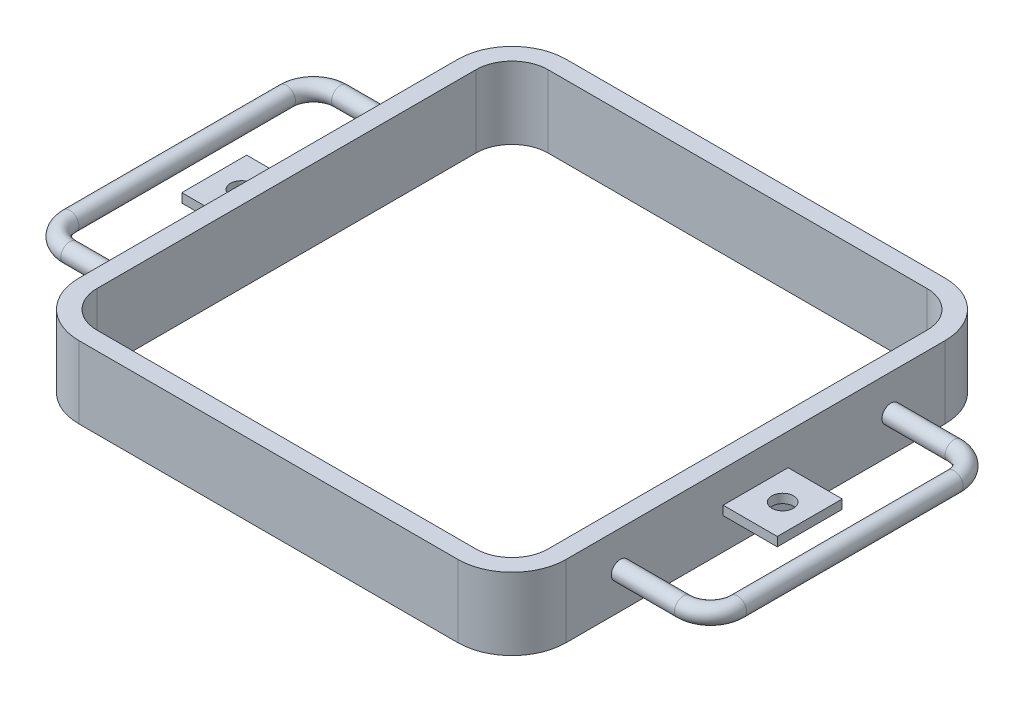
ISO-10303-21;
HEADER;
FILE_DESCRIPTION(('STEP AP214'),'2;1');
FILE_NAME('part.step','',(''),(''),'','','');
FILE_SCHEMA(('AUTOMOTIVE_DESIGN { 1 0 10303 214 1 1 1 1 }'));
ENDSEC;
DATA;
#1=APPLICATION_CONTEXT('core data for automotive mechanical design processes');
#2=APPLICATION_PROTOCOL_DEFINITION('international standard','automotive_design',2000,#1);
#3=PRODUCT_CONTEXT('',#1,'mechanical');
#4=PRODUCT('Part','Part','',(#3));
#5=PRODUCT_RELATED_PRODUCT_CATEGORY('part','',(#4));
#6=PRODUCT_DEFINITION_FORMATION('','',#4);
#7=PRODUCT_DEFINITION_CONTEXT('part definition',#1,'design');
#8=PRODUCT_DEFINITION('design','',#6,#7);
#9=PRODUCT_DEFINITION_SHAPE('','',#8);
#10=(LENGTH_UNIT() NAMED_UNIT(*) SI_UNIT(.MILLI.,.METRE.));
#11=(NAMED_UNIT(*) PLANE_ANGLE_UNIT() SI_UNIT($,.RADIAN.));
#12=(NAMED_UNIT(*) SI_UNIT($,.STERADIAN.) SOLID_ANGLE_UNIT());
#13=UNCERTAINTY_MEASURE_WITH_UNIT(LENGTH_MEASURE(1.E-05),#10,'distance_accuracy_value','');
#14=(GEOMETRIC_REPRESENTATION_CONTEXT(3) GLOBAL_UNCERTAINTY_ASSIGNED_CONTEXT((#13)) GLOBAL_UNIT_ASSIGNED_CONTEXT((#10,
#11,#12)) REPRESENTATION_CONTEXT('',''));
#15=CARTESIAN_POINT('',(0.,0.,0.));
#16=DIRECTION('',(0.,0.,1.));
#17=DIRECTION('',(1.,0.,0.));
#18=AXIS2_PLACEMENT_3D('',#15,#16,#17);
#19=CARTESIAN_POINT('',(135.,20.,-105.));
#20=DIRECTION('',(-1.,0.,0.));
#21=DIRECTION('',(0.,0.,1.));
#22=AXIS2_PLACEMENT_3D('',#19,#20,#21);
#23=PLANE('',#22);
#24=DIRECTION('',(0.,0.,-1.));
#25=VECTOR('',#24,1.);
#26=CARTESIAN_POINT('',(135.,-20.,-105.));
#27=LINE('',#26,#25);
#28=CARTESIAN_POINT('',(135.,-20.,105.));
#29=VERTEX_POINT('',#28);
#30=CARTESIAN_POINT('',(135.,-20.,-105.));
#31=VERTEX_POINT('',#30);
#32=EDGE_CURVE('E381',#29,#31,#27,.T.);
#33=ORIENTED_EDGE('',*,*,#32,.T.);
#34=DIRECTION('',(0.,-1.,0.));
#35=VECTOR('',#34,1.);
#36=CARTESIAN_POINT('',(135.,20.,-105.));
#37=LINE('',#36,#35);
#38=CARTESIAN_POINT('',(135.,20.,-105.));
#39=VERTEX_POINT('',#38);
#40=EDGE_CURVE('E391',#39,#31,#37,.T.);
#41=ORIENTED_EDGE('',*,*,#40,.F.);
#42=DIRECTION('',(0.,0.,-1.));
#43=VECTOR('',#42,1.);
#44=CARTESIAN_POINT('',(135.,20.,-105.));
#45=LINE('',#44,#43);
#46=CARTESIAN_POINT('',(135.,20.,105.));
#47=VERTEX_POINT('',#46);
#48=EDGE_CURVE('E364',#47,#39,#45,.T.);
#49=ORIENTED_EDGE('',*,*,#48,.F.);
#50=DIRECTION('',(0.,-1.,0.));
#51=VECTOR('',#50,1.);
#52=CARTESIAN_POINT('',(135.,20.,105.));
#53=LINE('',#52,#51);
#54=EDGE_CURVE('E394',#47,#29,#53,.T.);
#55=ORIENTED_EDGE('',*,*,#54,.T.);
#56=EDGE_LOOP('',(#33,#41,#49,#55));
#57=FACE_BOUND('',#56,.T.);
#58=CARTESIAN_POINT('',(135.,0.,-75.));
#59=DIRECTION('',(1.,0.,0.));
#60=DIRECTION('',(0.,0.,-1.));
#61=AXIS2_PLACEMENT_3D('',#58,#59,#60);
#62=CIRCLE('',#61,5.);
#63=CARTESIAN_POINT('',(135.,0.,-80.));
#64=VERTEX_POINT('',#63);
#65=EDGE_CURVE('E237',#64,#64,#62,.F.);
#66=ORIENTED_EDGE('',*,*,#65,.T.);
#67=EDGE_LOOP('',(#66));
#68=FACE_BOUND('',#67,.T.);
#69=CARTESIAN_POINT('',(135.,0.,75.));
#70=DIRECTION('',(-1.,0.,0.));
#71=DIRECTION('',(0.,0.,1.));
#72=AXIS2_PLACEMENT_3D('',#69,#70,#71);
#73=CIRCLE('',#72,5.);
#74=CARTESIAN_POINT('',(135.,0.,80.));
#75=VERTEX_POINT('',#74);
#76=EDGE_CURVE('E217',#75,#75,#73,.F.);
#77=ORIENTED_EDGE('',*,*,#76,.F.);
#78=EDGE_LOOP('',(#77));
#79=FACE_BOUND('',#78,.T.);
#80=DIRECTION('',(0.,0.,-1.));
#81=VECTOR('',#80,1.);
#82=CARTESIAN_POINT('',(135.,2.5,-18.));
#83=LINE('',#82,#81);
#84=CARTESIAN_POINT('',(135.,2.5,18.));
#85=VERTEX_POINT('',#84);
#86=CARTESIAN_POINT('',(135.,2.5,-18.));
#87=VERTEX_POINT('',#86);
#88=EDGE_CURVE('E196',#85,#87,#83,.T.);
#89=ORIENTED_EDGE('',*,*,#88,.T.);
#90=DIRECTION('',(0.,-1.,0.));
#91=VECTOR('',#90,1.);
#92=CARTESIAN_POINT('',(135.,2.5,-18.));
#93=LINE('',#92,#91);
#94=CARTESIAN_POINT('',(135.,-2.5,-18.));
#95=VERTEX_POINT('',#94);
#96=EDGE_CURVE('E512',#87,#95,#93,.T.);
#97=ORIENTED_EDGE('',*,*,#96,.T.);
#98=DIRECTION('',(0.,0.,-1.));
#99=VECTOR('',#98,1.);
#100=CARTESIAN_POINT('',(135.,-2.5,-18.));
#101=LINE('',#100,#99);
#102=CARTESIAN_POINT('',(135.,-2.5,18.));
#103=VERTEX_POINT('',#102);
#104=EDGE_CURVE('E216',#103,#95,#101,.T.);
#105=ORIENTED_EDGE('',*,*,#104,.F.);
#106=DIRECTION('',(0.,-1.,0.));
#107=VECTOR('',#106,1.);
#108=CARTESIAN_POINT('',(135.,2.5,18.));
#109=LINE('',#108,#107);
#110=EDGE_CURVE('E211',#85,#103,#109,.T.);
#111=ORIENTED_EDGE('',*,*,#110,.F.);
#112=EDGE_LOOP('',(#89,#97,#105,#111));
#113=FACE_BOUND('',#112,.T.);
#114=ADVANCED_FACE('F33',(#57,#68,#79,#113),#23,.F.);
#115=CARTESIAN_POINT('',(-135.,20.,-105.));
#116=DIRECTION('',(1.,0.,0.));
#117=DIRECTION('',(0.,0.,-1.));
#118=AXIS2_PLACEMENT_3D('',#115,#116,#117);
#119=PLANE('',#118);
#120=DIRECTION('',(0.,0.,1.));
#121=VECTOR('',#120,1.);
#122=CARTESIAN_POINT('',(-135.,-20.,-105.));
#123=LINE('',#122,#121);
#124=CARTESIAN_POINT('',(-135.,-20.,-105.));
#125=VERTEX_POINT('',#124);
#126=CARTESIAN_POINT('',(-135.,-20.,105.));
#127=VERTEX_POINT('',#126);
#128=EDGE_CURVE('E373',#125,#127,#123,.T.);
#129=ORIENTED_EDGE('',*,*,#128,.T.);
#130=DIRECTION('',(0.,-1.,0.));
#131=VECTOR('',#130,1.);
#132=CARTESIAN_POINT('',(-135.,20.,105.));
#133=LINE('',#132,#131);
#134=CARTESIAN_POINT('',(-135.,20.,105.));
#135=VERTEX_POINT('',#134);
#136=EDGE_CURVE('E41',#135,#127,#133,.T.);
#137=ORIENTED_EDGE('',*,*,#136,.F.);
#138=DIRECTION('',(0.,0.,1.));
#139=VECTOR('',#138,1.);
#140=CARTESIAN_POINT('',(-135.,20.,-105.));
#141=LINE('',#140,#139);
#142=CARTESIAN_POINT('',(-135.,20.,-105.));
#143=VERTEX_POINT('',#142);
#144=EDGE_CURVE('E355',#143,#135,#141,.T.);
#145=ORIENTED_EDGE('',*,*,#144,.F.);
#146=DIRECTION('',(0.,-1.,0.));
#147=VECTOR('',#146,1.);
#148=CARTESIAN_POINT('',(-135.,20.,-105.));
#149=LINE('',#148,#147);
#150=EDGE_CURVE('E11',#143,#125,#149,.T.);
#151=ORIENTED_EDGE('',*,*,#150,.T.);
#152=EDGE_LOOP('',(#129,#137,#145,#151));
#153=FACE_BOUND('',#152,.T.);
#154=CARTESIAN_POINT('',(-135.,0.,-75.));
#155=DIRECTION('',(1.,0.,0.));
#156=DIRECTION('',(0.,0.,-1.));
#157=AXIS2_PLACEMENT_3D('',#154,#155,#156);
#158=CIRCLE('',#157,5.);
#159=CARTESIAN_POINT('',(-135.,0.,-80.));
#160=VERTEX_POINT('',#159);
#161=EDGE_CURVE('E289',#160,#160,#158,.T.);
#162=ORIENTED_EDGE('',*,*,#161,.T.);
#163=EDGE_LOOP('',(#162));
#164=FACE_BOUND('',#163,.T.);
#165=CARTESIAN_POINT('',(-135.,0.,75.));
#166=DIRECTION('',(-1.,0.,0.));
#167=DIRECTION('',(0.,0.,1.));
#168=AXIS2_PLACEMENT_3D('',#165,#166,#167);
#169=CIRCLE('',#168,5.);
#170=CARTESIAN_POINT('',(-135.,0.,80.));
#171=VERTEX_POINT('',#170);
#172=EDGE_CURVE('E274',#171,#171,#169,.T.);
#173=ORIENTED_EDGE('',*,*,#172,.F.);
#174=EDGE_LOOP('',(#173));
#175=FACE_BOUND('',#174,.T.);
#176=DIRECTION('',(0.,-1.,0.));
#177=VECTOR('',#176,1.);
#178=CARTESIAN_POINT('',(-135.,2.5,-18.));
#179=LINE('',#178,#177);
#180=CARTESIAN_POINT('',(-135.,2.5,-18.));
#181=VERTEX_POINT('',#180);
#182=CARTESIAN_POINT('',(-135.,-2.5,-18.));
#183=VERTEX_POINT('',#182);
#184=EDGE_CURVE('E56',#181,#183,#179,.T.);
#185=ORIENTED_EDGE('',*,*,#184,.F.);
#186=DIRECTION('',(0.,0.,-1.));
#187=VECTOR('',#186,1.);
#188=CARTESIAN_POINT('',(-135.,2.5,-18.));
#189=LINE('',#188,#187);
#190=CARTESIAN_POINT('',(-135.,2.5,18.));
#191=VERTEX_POINT('',#190);
#192=EDGE_CURVE('E247',#191,#181,#189,.T.);
#193=ORIENTED_EDGE('',*,*,#192,.F.);
#194=DIRECTION('',(0.,-1.,0.));
#195=VECTOR('',#194,1.);
#196=CARTESIAN_POINT('',(-135.,2.5,18.));
#197=LINE('',#196,#195);
#198=CARTESIAN_POINT('',(-135.,-2.5,18.));
#199=VERTEX_POINT('',#198);
#200=EDGE_CURVE('E258',#191,#199,#197,.T.);
#201=ORIENTED_EDGE('',*,*,#200,.T.);
#202=DIRECTION('',(0.,0.,-1.));
#203=VECTOR('',#202,1.);
#204=CARTESIAN_POINT('',(-135.,-2.5,-18.));
#205=LINE('',#204,#203);
#206=EDGE_CURVE('E244',#199,#183,#205,.T.);
#207=ORIENTED_EDGE('',*,*,#206,.T.);
#208=EDGE_LOOP('',(#185,#193,#201,#207));
#209=FACE_BOUND('',#208,.T.);
#210=ADVANCED_FACE('F432',(#153,#164,#175,#209),#119,.F.);
#211=CARTESIAN_POINT('',(-105.,20.,-105.));
#212=DIRECTION('',(0.,1.,0.));
#213=DIRECTION('',(0.,0.,1.));
#214=AXIS2_PLACEMENT_3D('',#211,#212,#213);
#215=PLANE('',#214);
#216=CARTESIAN_POINT('',(-105.,20.,-105.));
#217=DIRECTION('',(0.,1.,0.));
#218=DIRECTION('',(0.,0.,1.));
#219=AXIS2_PLACEMENT_3D('',#216,#217,#218);
#220=CIRCLE('',#219,30.);
#221=CARTESIAN_POINT('',(-105.,20.,-135.));
#222=VERTEX_POINT('',#221);
#223=EDGE_CURVE('E352',#222,#143,#220,.T.);
#224=ORIENTED_EDGE('',*,*,#223,.T.);
#225=ORIENTED_EDGE('',*,*,#144,.T.);
#226=CARTESIAN_POINT('',(-105.,20.,105.));
#227=DIRECTION('',(0.,1.,0.));
#228=DIRECTION('',(0.,0.,1.));
#229=AXIS2_PLACEMENT_3D('',#226,#227,#228);
#230=CIRCLE('',#229,30.);
#231=CARTESIAN_POINT('',(-105.,20.,135.));
#232=VERTEX_POINT('',#231);
#233=EDGE_CURVE('E358',#135,#232,#230,.T.);
#234=ORIENTED_EDGE('',*,*,#233,.T.);
#235=DIRECTION('',(1.,0.,0.));
#236=VECTOR('',#235,1.);
#237=CARTESIAN_POINT('',(-105.,20.,135.));
#238=LINE('',#237,#236);
#239=CARTESIAN_POINT('',(105.,20.,135.));
#240=VERTEX_POINT('',#239);
#241=EDGE_CURVE('E360',#232,#240,#238,.T.);
#242=ORIENTED_EDGE('',*,*,#241,.T.);
#243=CARTESIAN_POINT('',(105.,20.,105.));
#244=DIRECTION('',(0.,1.,0.));
#245=DIRECTION('',(0.,0.,1.));
#246=AXIS2_PLACEMENT_3D('',#243,#244,#245);
#247=CIRCLE('',#246,30.);
#248=EDGE_CURVE('E362',#240,#47,#247,.T.);
#249=ORIENTED_EDGE('',*,*,#248,.T.);
#250=ORIENTED_EDGE('',*,*,#48,.T.);
#251=CARTESIAN_POINT('',(105.,20.,-105.));
#252=DIRECTION('',(0.,1.,0.));
#253=DIRECTION('',(0.,0.,-1.));
#254=AXIS2_PLACEMENT_3D('',#251,#252,#253);
#255=CIRCLE('',#254,30.);
#256=CARTESIAN_POINT('',(105.,20.,-135.));
#257=VERTEX_POINT('',#256);
#258=EDGE_CURVE('E366',#39,#257,#255,.T.);
#259=ORIENTED_EDGE('',*,*,#258,.T.);
#260=DIRECTION('',(-1.,0.,0.));
#261=VECTOR('',#260,1.);
#262=CARTESIAN_POINT('',(-105.,20.,-135.));
#263=LINE('',#262,#261);
#264=EDGE_CURVE('E368',#257,#222,#263,.T.);
#265=ORIENTED_EDGE('',*,*,#264,.T.);
#266=EDGE_LOOP('',(#224,#225,#234,#242,#249,#250,#259,#265));
#267=FACE_BOUND('',#266,.T.);
#268=DIRECTION('',(-1.,0.,0.));
#269=VECTOR('',#268,1.);
#270=CARTESIAN_POINT('',(-105.,20.,-125.));
#271=LINE('',#270,#269);
#272=CARTESIAN_POINT('',(105.,20.,-125.));
#273=VERTEX_POINT('',#272);
#274=CARTESIAN_POINT('',(-105.,20.,-125.));
#275=VERTEX_POINT('',#274);
#276=EDGE_CURVE('E295',#273,#275,#271,.T.);
#277=ORIENTED_EDGE('',*,*,#276,.F.);
#278=CARTESIAN_POINT('',(105.,20.,-105.));
#279=DIRECTION('',(0.,1.,0.));
#280=DIRECTION('',(0.,0.,-1.));
#281=AXIS2_PLACEMENT_3D('',#278,#279,#280);
#282=CIRCLE('',#281,20.);
#283=CARTESIAN_POINT('',(125.,20.,-105.));
#284=VERTEX_POINT('',#283);
#285=EDGE_CURVE('E293',#284,#273,#282,.T.);
#286=ORIENTED_EDGE('',*,*,#285,.F.);
#287=DIRECTION('',(0.,0.,-1.));
#288=VECTOR('',#287,1.);
#289=CARTESIAN_POINT('',(125.,20.,-105.));
#290=LINE('',#289,#288);
#291=CARTESIAN_POINT('',(125.,20.,105.));
#292=VERTEX_POINT('',#291);
#293=EDGE_CURVE('E309',#292,#284,#290,.T.);
#294=ORIENTED_EDGE('',*,*,#293,.F.);
#295=CARTESIAN_POINT('',(105.,20.,105.));
#296=DIRECTION('',(0.,1.,0.));
#297=DIRECTION('',(0.,0.,1.));
#298=AXIS2_PLACEMENT_3D('',#295,#296,#297);
#299=CIRCLE('',#298,20.);
#300=CARTESIAN_POINT('',(105.,20.,125.));
#301=VERTEX_POINT('',#300);
#302=EDGE_CURVE('E306',#301,#292,#299,.T.);
#303=ORIENTED_EDGE('',*,*,#302,.F.);
#304=DIRECTION('',(1.,0.,0.));
#305=VECTOR('',#304,1.);
#306=CARTESIAN_POINT('',(-105.,20.,125.));
#307=LINE('',#306,#305);
#308=CARTESIAN_POINT('',(-105.,20.,125.));
#309=VERTEX_POINT('',#308);
#310=EDGE_CURVE('E304',#309,#301,#307,.T.);
#311=ORIENTED_EDGE('',*,*,#310,.F.);
#312=CARTESIAN_POINT('',(-105.,20.,105.));
#313=DIRECTION('',(0.,1.,0.));
#314=DIRECTION('',(0.,0.,1.));
#315=AXIS2_PLACEMENT_3D('',#312,#313,#314);
#316=CIRCLE('',#315,20.);
#317=CARTESIAN_POINT('',(-125.,20.,105.));
#318=VERTEX_POINT('',#317);
#319=EDGE_CURVE('E302',#318,#309,#316,.T.);
#320=ORIENTED_EDGE('',*,*,#319,.F.);
#321=DIRECTION('',(0.,0.,1.));
#322=VECTOR('',#321,1.);
#323=CARTESIAN_POINT('',(-125.,20.,-105.));
#324=LINE('',#323,#322);
#325=CARTESIAN_POINT('',(-125.,20.,-105.));
#326=VERTEX_POINT('',#325);
#327=EDGE_CURVE('E300',#326,#318,#324,.T.);
#328=ORIENTED_EDGE('',*,*,#327,.F.);
#329=CARTESIAN_POINT('',(-105.,20.,-105.));
#330=DIRECTION('',(0.,1.,0.));
#331=DIRECTION('',(0.,0.,1.));
#332=AXIS2_PLACEMENT_3D('',#329,#330,#331);
#333=CIRCLE('',#332,20.);
#334=EDGE_CURVE('E298',#275,#326,#333,.T.);
#335=ORIENTED_EDGE('',*,*,#334,.F.);
#336=EDGE_LOOP('',(#277,#286,#294,#303,#311,#320,#328,#335));
#337=FACE_BOUND('',#336,.T.);
#338=ADVANCED_FACE('F427',(#267,#337),#215,.T.);
#339=CARTESIAN_POINT('',(-105.,-20.,-105.));
#340=DIRECTION('',(0.,1.,0.));
#341=DIRECTION('',(0.,0.,1.));
#342=AXIS2_PLACEMENT_3D('',#339,#340,#341);
#343=PLANE('',#342);
#344=CARTESIAN_POINT('',(-105.,-20.,-105.));
#345=DIRECTION('',(0.,1.,0.));
#346=DIRECTION('',(0.,0.,1.));
#347=AXIS2_PLACEMENT_3D('',#344,#345,#346);
#348=CIRCLE('',#347,30.);
#349=CARTESIAN_POINT('',(-105.,-20.,-135.));
#350=VERTEX_POINT('',#349);
#351=EDGE_CURVE('E351',#350,#125,#348,.T.);
#352=ORIENTED_EDGE('',*,*,#351,.F.);
#353=DIRECTION('',(-1.,0.,0.));
#354=VECTOR('',#353,1.);
#355=CARTESIAN_POINT('',(-105.,-20.,-135.));
#356=LINE('',#355,#354);
#357=CARTESIAN_POINT('',(105.,-20.,-135.));
#358=VERTEX_POINT('',#357);
#359=EDGE_CURVE('E356',#358,#350,#356,.T.);
#360=ORIENTED_EDGE('',*,*,#359,.F.);
#361=CARTESIAN_POINT('',(105.,-20.,-105.));
#362=DIRECTION('',(0.,1.,0.));
#363=DIRECTION('',(0.,0.,-1.));
#364=AXIS2_PLACEMENT_3D('',#361,#362,#363);
#365=CIRCLE('',#364,30.);
#366=EDGE_CURVE('E383',#31,#358,#365,.T.);
#367=ORIENTED_EDGE('',*,*,#366,.F.);
#368=ORIENTED_EDGE('',*,*,#32,.F.);
#369=CARTESIAN_POINT('',(105.,-20.,105.));
#370=DIRECTION('',(0.,1.,0.));
#371=DIRECTION('',(0.,0.,1.));
#372=AXIS2_PLACEMENT_3D('',#369,#370,#371);
#373=CIRCLE('',#372,30.);
#374=CARTESIAN_POINT('',(105.,-20.,135.));
#375=VERTEX_POINT('',#374);
#376=EDGE_CURVE('E379',#375,#29,#373,.T.);
#377=ORIENTED_EDGE('',*,*,#376,.F.);
#378=DIRECTION('',(1.,0.,0.));
#379=VECTOR('',#378,1.);
#380=CARTESIAN_POINT('',(-105.,-20.,135.));
#381=LINE('',#380,#379);
#382=CARTESIAN_POINT('',(-105.,-20.,135.));
#383=VERTEX_POINT('',#382);
#384=EDGE_CURVE('E377',#383,#375,#381,.T.);
#385=ORIENTED_EDGE('',*,*,#384,.F.);
#386=CARTESIAN_POINT('',(-105.,-20.,105.));
#387=DIRECTION('',(0.,1.,0.));
#388=DIRECTION('',(0.,0.,1.));
#389=AXIS2_PLACEMENT_3D('',#386,#387,#388);
#390=CIRCLE('',#389,30.);
#391=EDGE_CURVE('E375',#127,#383,#390,.T.);
#392=ORIENTED_EDGE('',*,*,#391,.F.);
#393=ORIENTED_EDGE('',*,*,#128,.F.);
#394=EDGE_LOOP('',(#352,#360,#367,#368,#377,#385,#392,#393));
#395=FACE_BOUND('',#394,.T.);
#396=CARTESIAN_POINT('',(105.,-20.,-105.));
#397=DIRECTION('',(0.,1.,0.));
#398=DIRECTION('',(0.,0.,-1.));
#399=AXIS2_PLACEMENT_3D('',#396,#397,#398);
#400=CIRCLE('',#399,20.);
#401=CARTESIAN_POINT('',(125.,-20.,-105.));
#402=VERTEX_POINT('',#401);
#403=CARTESIAN_POINT('',(105.,-20.,-125.));
#404=VERTEX_POINT('',#403);
#405=EDGE_CURVE('E292',#402,#404,#400,.T.);
#406=ORIENTED_EDGE('',*,*,#405,.T.);
#407=DIRECTION('',(-1.,0.,0.));
#408=VECTOR('',#407,1.);
#409=CARTESIAN_POINT('',(-105.,-20.,-125.));
#410=LINE('',#409,#408);
#411=CARTESIAN_POINT('',(-105.,-20.,-125.));
#412=VERTEX_POINT('',#411);
#413=EDGE_CURVE('E314',#404,#412,#410,.T.);
#414=ORIENTED_EDGE('',*,*,#413,.T.);
#415=CARTESIAN_POINT('',(-105.,-20.,-105.));
#416=DIRECTION('',(0.,1.,0.));
#417=DIRECTION('',(0.,0.,1.));
#418=AXIS2_PLACEMENT_3D('',#415,#416,#417);
#419=CIRCLE('',#418,20.);
#420=CARTESIAN_POINT('',(-125.,-20.,-105.));
#421=VERTEX_POINT('',#420);
#422=EDGE_CURVE('E317',#412,#421,#419,.T.);
#423=ORIENTED_EDGE('',*,*,#422,.T.);
#424=DIRECTION('',(0.,0.,1.));
#425=VECTOR('',#424,1.);
#426=CARTESIAN_POINT('',(-125.,-20.,-105.));
#427=LINE('',#426,#425);
#428=CARTESIAN_POINT('',(-125.,-20.,105.));
#429=VERTEX_POINT('',#428);
#430=EDGE_CURVE('E320',#421,#429,#427,.T.);
#431=ORIENTED_EDGE('',*,*,#430,.T.);
#432=CARTESIAN_POINT('',(-105.,-20.,105.));
#433=DIRECTION('',(0.,1.,0.));
#434=DIRECTION('',(0.,0.,1.));
#435=AXIS2_PLACEMENT_3D('',#432,#433,#434);
#436=CIRCLE('',#435,20.);
#437=CARTESIAN_POINT('',(-105.,-20.,125.));
#438=VERTEX_POINT('',#437);
#439=EDGE_CURVE('E323',#429,#438,#436,.T.);
#440=ORIENTED_EDGE('',*,*,#439,.T.);
#441=DIRECTION('',(1.,0.,0.));
#442=VECTOR('',#441,1.);
#443=CARTESIAN_POINT('',(-105.,-20.,125.));
#444=LINE('',#443,#442);
#445=CARTESIAN_POINT('',(105.,-20.,125.));
#446=VERTEX_POINT('',#445);
#447=EDGE_CURVE('E326',#438,#446,#444,.T.);
#448=ORIENTED_EDGE('',*,*,#447,.T.);
#449=CARTESIAN_POINT('',(105.,-20.,105.));
#450=DIRECTION('',(0.,1.,0.));
#451=DIRECTION('',(0.,0.,1.));
#452=AXIS2_PLACEMENT_3D('',#449,#450,#451);
#453=CIRCLE('',#452,20.);
#454=CARTESIAN_POINT('',(125.,-20.,105.));
#455=VERTEX_POINT('',#454);
#456=EDGE_CURVE('E329',#446,#455,#453,.T.);
#457=ORIENTED_EDGE('',*,*,#456,.T.);
#458=DIRECTION('',(0.,0.,-1.));
#459=VECTOR('',#458,1.);
#460=CARTESIAN_POINT('',(125.,-20.,-105.));
#461=LINE('',#460,#459);
#462=EDGE_CURVE('E296',#455,#402,#461,.T.);
#463=ORIENTED_EDGE('',*,*,#462,.T.);
#464=EDGE_LOOP('',(#406,#414,#423,#431,#440,#448,#457,#463));
#465=FACE_BOUND('',#464,.T.);
#466=ADVANCED_FACE('F413',(#395,#465),#343,.F.);
#467=CARTESIAN_POINT('',(-105.,20.,-105.));
#468=DIRECTION('',(0.,-1.,0.));
#469=DIRECTION('',(0.,0.,-1.));
#470=AXIS2_PLACEMENT_3D('',#467,#468,#469);
#471=CYLINDRICAL_SURFACE('',#470,30.);
#472=ORIENTED_EDGE('',*,*,#351,.T.);
#473=ORIENTED_EDGE('',*,*,#150,.F.);
#474=ORIENTED_EDGE('',*,*,#223,.F.);
#475=DIRECTION('',(0.,-1.,0.));
#476=VECTOR('',#475,1.);
#477=CARTESIAN_POINT('',(-105.,20.,-135.));
#478=LINE('',#477,#476);
#479=EDGE_CURVE('E370',#222,#350,#478,.T.);
#480=ORIENTED_EDGE('',*,*,#479,.T.);
#481=EDGE_LOOP('',(#472,#473,#474,#480));
#482=FACE_BOUND('',#481,.T.);
#483=ADVANCED_FACE('F35',(#482),#471,.T.);
#484=CARTESIAN_POINT('',(-105.,20.,105.));
#485=DIRECTION('',(0.,-1.,0.));
#486=DIRECTION('',(0.,0.,-1.));
#487=AXIS2_PLACEMENT_3D('',#484,#485,#486);
#488=CYLINDRICAL_SURFACE('',#487,30.);
#489=ORIENTED_EDGE('',*,*,#391,.T.);
#490=DIRECTION('',(0.,-1.,0.));
#491=VECTOR('',#490,1.);
#492=CARTESIAN_POINT('',(-105.,20.,135.));
#493=LINE('',#492,#491);
#494=EDGE_CURVE('E400',#232,#383,#493,.T.);
#495=ORIENTED_EDGE('',*,*,#494,.F.);
#496=ORIENTED_EDGE('',*,*,#233,.F.);
#497=ORIENTED_EDGE('',*,*,#136,.T.);
#498=EDGE_LOOP('',(#489,#495,#496,#497));
#499=FACE_BOUND('',#498,.T.);
#500=ADVANCED_FACE('F407',(#499),#488,.T.);
#501=CARTESIAN_POINT('',(-105.,20.,135.));
#502=DIRECTION('',(0.,0.,-1.));
#503=DIRECTION('',(-1.,0.,0.));
#504=AXIS2_PLACEMENT_3D('',#501,#502,#503);
#505=PLANE('',#504);
#506=ORIENTED_EDGE('',*,*,#384,.T.);
#507=DIRECTION('',(0.,-1.,0.));
#508=VECTOR('',#507,1.);
#509=CARTESIAN_POINT('',(105.,20.,135.));
#510=LINE('',#509,#508);
#511=EDGE_CURVE('E397',#240,#375,#510,.T.);
#512=ORIENTED_EDGE('',*,*,#511,.F.);
#513=ORIENTED_EDGE('',*,*,#241,.F.);
#514=ORIENTED_EDGE('',*,*,#494,.T.);
#515=EDGE_LOOP('',(#506,#512,#513,#514));
#516=FACE_BOUND('',#515,.T.);
#517=ADVANCED_FACE('F419',(#516),#505,.F.);
#518=CARTESIAN_POINT('',(105.,20.,105.));
#519=DIRECTION('',(0.,-1.,0.));
#520=DIRECTION('',(0.,0.,-1.));
#521=AXIS2_PLACEMENT_3D('',#518,#519,#520);
#522=CYLINDRICAL_SURFACE('',#521,30.);
#523=ORIENTED_EDGE('',*,*,#376,.T.);
#524=ORIENTED_EDGE('',*,*,#54,.F.);
#525=ORIENTED_EDGE('',*,*,#248,.F.);
#526=ORIENTED_EDGE('',*,*,#511,.T.);
#527=EDGE_LOOP('',(#523,#524,#525,#526));
#528=FACE_BOUND('',#527,.T.);
#529=ADVANCED_FACE('F423',(#528),#522,.T.);
#530=CARTESIAN_POINT('',(105.,20.,-105.));
#531=DIRECTION('',(0.,-1.,0.));
#532=DIRECTION('',(0.,0.,-1.));
#533=AXIS2_PLACEMENT_3D('',#530,#531,#532);
#534=CYLINDRICAL_SURFACE('',#533,30.);
#535=ORIENTED_EDGE('',*,*,#366,.T.);
#536=DIRECTION('',(0.,-1.,0.));
#537=VECTOR('',#536,1.);
#538=CARTESIAN_POINT('',(105.,20.,-135.));
#539=LINE('',#538,#537);
#540=EDGE_CURVE('E388',#257,#358,#539,.T.);
#541=ORIENTED_EDGE('',*,*,#540,.F.);
#542=ORIENTED_EDGE('',*,*,#258,.F.);
#543=ORIENTED_EDGE('',*,*,#40,.T.);
#544=EDGE_LOOP('',(#535,#541,#542,#543));
#545=FACE_BOUND('',#544,.T.);
#546=ADVANCED_FACE('F444',(#545),#534,.T.);
#547=CARTESIAN_POINT('',(-105.,20.,-135.));
#548=DIRECTION('',(0.,0.,1.));
#549=DIRECTION('',(1.,0.,0.));
#550=AXIS2_PLACEMENT_3D('',#547,#548,#549);
#551=PLANE('',#550);
#552=ORIENTED_EDGE('',*,*,#359,.T.);
#553=ORIENTED_EDGE('',*,*,#479,.F.);
#554=ORIENTED_EDGE('',*,*,#264,.F.);
#555=ORIENTED_EDGE('',*,*,#540,.T.);
#556=EDGE_LOOP('',(#552,#553,#554,#555));
#557=FACE_BOUND('',#556,.T.);
#558=ADVANCED_FACE('F439',(#557),#551,.F.);
#559=CARTESIAN_POINT('',(105.,20.,-105.));
#560=DIRECTION('',(0.,-1.,0.));
#561=DIRECTION('',(0.,0.,-1.));
#562=AXIS2_PLACEMENT_3D('',#559,#560,#561);
#563=CYLINDRICAL_SURFACE('',#562,20.);
#564=ORIENTED_EDGE('',*,*,#405,.F.);
#565=DIRECTION('',(0.,-1.,0.));
#566=VECTOR('',#565,1.);
#567=CARTESIAN_POINT('',(125.,20.,-105.));
#568=LINE('',#567,#566);
#569=EDGE_CURVE('E311',#284,#402,#568,.T.);
#570=ORIENTED_EDGE('',*,*,#569,.F.);
#571=ORIENTED_EDGE('',*,*,#285,.T.);
#572=DIRECTION('',(0.,-1.,0.));
#573=VECTOR('',#572,1.);
#574=CARTESIAN_POINT('',(105.,20.,-125.));
#575=LINE('',#574,#573);
#576=EDGE_CURVE('E348',#273,#404,#575,.T.);
#577=ORIENTED_EDGE('',*,*,#576,.T.);
#578=EDGE_LOOP('',(#564,#570,#571,#577));
#579=FACE_BOUND('',#578,.T.);
#580=ADVANCED_FACE('F764',(#579),#563,.F.);
#581=CARTESIAN_POINT('',(-105.,20.,-125.));
#582=DIRECTION('',(0.,0.,1.));
#583=DIRECTION('',(1.,0.,0.));
#584=AXIS2_PLACEMENT_3D('',#581,#582,#583);
#585=PLANE('',#584);
#586=ORIENTED_EDGE('',*,*,#413,.F.);
#587=ORIENTED_EDGE('',*,*,#576,.F.);
#588=ORIENTED_EDGE('',*,*,#276,.T.);
#589=DIRECTION('',(0.,-1.,0.));
#590=VECTOR('',#589,1.);
#591=CARTESIAN_POINT('',(-105.,20.,-125.));
#592=LINE('',#591,#590);
#593=EDGE_CURVE('E346',#275,#412,#592,.T.);
#594=ORIENTED_EDGE('',*,*,#593,.T.);
#595=EDGE_LOOP('',(#586,#587,#588,#594));
#596=FACE_BOUND('',#595,.T.);
#597=ADVANCED_FACE('F754',(#596),#585,.T.);
#598=CARTESIAN_POINT('',(-105.,20.,-105.));
#599=DIRECTION('',(0.,-1.,0.));
#600=DIRECTION('',(0.,0.,-1.));
#601=AXIS2_PLACEMENT_3D('',#598,#599,#600);
#602=CYLINDRICAL_SURFACE('',#601,20.);
#603=ORIENTED_EDGE('',*,*,#422,.F.);
#604=ORIENTED_EDGE('',*,*,#593,.F.);
#605=ORIENTED_EDGE('',*,*,#334,.T.);
#606=DIRECTION('',(0.,-1.,0.));
#607=VECTOR('',#606,1.);
#608=CARTESIAN_POINT('',(-125.,20.,-105.));
#609=LINE('',#608,#607);
#610=EDGE_CURVE('E344',#326,#421,#609,.T.);
#611=ORIENTED_EDGE('',*,*,#610,.T.);
#612=EDGE_LOOP('',(#603,#604,#605,#611));
#613=FACE_BOUND('',#612,.T.);
#614=ADVANCED_FACE('F744',(#613),#602,.F.);
#615=CARTESIAN_POINT('',(-125.,20.,-105.));
#616=DIRECTION('',(1.,0.,0.));
#617=DIRECTION('',(0.,0.,-1.));
#618=AXIS2_PLACEMENT_3D('',#615,#616,#617);
#619=PLANE('',#618);
#620=ORIENTED_EDGE('',*,*,#430,.F.);
#621=ORIENTED_EDGE('',*,*,#610,.F.);
#622=ORIENTED_EDGE('',*,*,#327,.T.);
#623=DIRECTION('',(0.,-1.,0.));
#624=VECTOR('',#623,1.);
#625=CARTESIAN_POINT('',(-125.,20.,105.));
#626=LINE('',#625,#624);
#627=EDGE_CURVE('E342',#318,#429,#626,.T.);
#628=ORIENTED_EDGE('',*,*,#627,.T.);
#629=EDGE_LOOP('',(#620,#621,#622,#628));
#630=FACE_BOUND('',#629,.T.);
#631=ADVANCED_FACE('F734',(#630),#619,.T.);
#632=CARTESIAN_POINT('',(-105.,20.,105.));
#633=DIRECTION('',(0.,-1.,0.));
#634=DIRECTION('',(0.,0.,-1.));
#635=AXIS2_PLACEMENT_3D('',#632,#633,#634);
#636=CYLINDRICAL_SURFACE('',#635,20.);
#637=ORIENTED_EDGE('',*,*,#439,.F.);
#638=ORIENTED_EDGE('',*,*,#627,.F.);
#639=ORIENTED_EDGE('',*,*,#319,.T.);
#640=DIRECTION('',(0.,-1.,0.));
#641=VECTOR('',#640,1.);
#642=CARTESIAN_POINT('',(-105.,20.,125.));
#643=LINE('',#642,#641);
#644=EDGE_CURVE('E340',#309,#438,#643,.T.);
#645=ORIENTED_EDGE('',*,*,#644,.T.);
#646=EDGE_LOOP('',(#637,#638,#639,#645));
#647=FACE_BOUND('',#646,.T.);
#648=ADVANCED_FACE('F724',(#647),#636,.F.);
#649=CARTESIAN_POINT('',(-105.,20.,125.));
#650=DIRECTION('',(0.,0.,-1.));
#651=DIRECTION('',(-1.,0.,0.));
#652=AXIS2_PLACEMENT_3D('',#649,#650,#651);
#653=PLANE('',#652);
#654=ORIENTED_EDGE('',*,*,#447,.F.);
#655=ORIENTED_EDGE('',*,*,#644,.F.);
#656=ORIENTED_EDGE('',*,*,#310,.T.);
#657=DIRECTION('',(0.,-1.,0.));
#658=VECTOR('',#657,1.);
#659=CARTESIAN_POINT('',(105.,20.,125.));
#660=LINE('',#659,#658);
#661=EDGE_CURVE('E338',#301,#446,#660,.T.);
#662=ORIENTED_EDGE('',*,*,#661,.T.);
#663=EDGE_LOOP('',(#654,#655,#656,#662));
#664=FACE_BOUND('',#663,.T.);
#665=ADVANCED_FACE('F714',(#664),#653,.T.);
#666=CARTESIAN_POINT('',(105.,20.,105.));
#667=DIRECTION('',(0.,-1.,0.));
#668=DIRECTION('',(0.,0.,-1.));
#669=AXIS2_PLACEMENT_3D('',#666,#667,#668);
#670=CYLINDRICAL_SURFACE('',#669,20.);
#671=ORIENTED_EDGE('',*,*,#456,.F.);
#672=ORIENTED_EDGE('',*,*,#661,.F.);
#673=ORIENTED_EDGE('',*,*,#302,.T.);
#674=DIRECTION('',(0.,-1.,0.));
#675=VECTOR('',#674,1.);
#676=CARTESIAN_POINT('',(125.,20.,105.));
#677=LINE('',#676,#675);
#678=EDGE_CURVE('E336',#292,#455,#677,.T.);
#679=ORIENTED_EDGE('',*,*,#678,.T.);
#680=EDGE_LOOP('',(#671,#672,#673,#679));
#681=FACE_BOUND('',#680,.T.);
#682=ADVANCED_FACE('F704',(#681),#670,.F.);
#683=CARTESIAN_POINT('',(125.,20.,-105.));
#684=DIRECTION('',(-1.,0.,0.));
#685=DIRECTION('',(0.,0.,1.));
#686=AXIS2_PLACEMENT_3D('',#683,#684,#685);
#687=PLANE('',#686);
#688=ORIENTED_EDGE('',*,*,#462,.F.);
#689=ORIENTED_EDGE('',*,*,#678,.F.);
#690=ORIENTED_EDGE('',*,*,#293,.T.);
#691=ORIENTED_EDGE('',*,*,#569,.T.);
#692=EDGE_LOOP('',(#688,#689,#690,#691));
#693=FACE_BOUND('',#692,.T.);
#694=ADVANCED_FACE('F658',(#693),#687,.T.);
#695=CARTESIAN_POINT('',(-135.,0.,75.));
#696=DIRECTION('',(-1.,0.,0.));
#697=DIRECTION('',(0.,0.,1.));
#698=AXIS2_PLACEMENT_3D('',#695,#696,#697);
#699=CYLINDRICAL_SURFACE('',#698,5.);
#700=CARTESIAN_POINT('',(-170.,0.,75.));
#701=DIRECTION('',(-1.,0.,0.));
#702=DIRECTION('',(0.,0.,1.));
#703=AXIS2_PLACEMENT_3D('',#700,#701,#702);
#704=CIRCLE('',#703,5.);
#705=CARTESIAN_POINT('',(-170.,0.,79.9999999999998));
#706=VERTEX_POINT('',#705);
#707=EDGE_CURVE('E277',#706,#706,#704,.T.);
#708=ORIENTED_EDGE('',*,*,#707,.F.);
#709=EDGE_LOOP('',(#708));
#710=FACE_BOUND('',#709,.T.);
#711=ORIENTED_EDGE('',*,*,#172,.T.);
#712=EDGE_LOOP('',(#711));
#713=FACE_BOUND('',#712,.T.);
#714=ADVANCED_FACE('F640',(#710,#713),#699,.T.);
#715=CARTESIAN_POINT('',(-170.,0.,60.));
#716=DIRECTION('',(0.,-1.,0.));
#717=DIRECTION('',(0.,0.,-1.));
#718=AXIS2_PLACEMENT_3D('',#715,#716,#717);
#719=TOROIDAL_SURFACE('',#718,14.9999999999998,5.);
#720=CARTESIAN_POINT('',(-185.,0.,60.));
#721=DIRECTION('',(0.,0.,-1.));
#722=DIRECTION('',(-1.,0.,0.));
#723=AXIS2_PLACEMENT_3D('',#720,#721,#722);
#724=CIRCLE('',#723,5.);
#725=CARTESIAN_POINT('',(-190.,0.,60.));
#726=VERTEX_POINT('',#725);
#727=EDGE_CURVE('E280',#726,#726,#724,.T.);
#728=CARTESIAN_POINT('',(-170.,0.,60.));
#729=DIRECTION('',(0.,-1.,0.));
#730=DIRECTION('',(0.,0.,-1.));
#731=AXIS2_PLACEMENT_3D('',#728,#729,#730);
#732=CIRCLE('',#731,19.9999999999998);
#733=EDGE_CURVE('',#706,#726,#732,.T.);
#734=ORIENTED_EDGE('',*,*,#707,.T.);
#735=ORIENTED_EDGE('',*,*,#727,.F.);
#736=ORIENTED_EDGE('',*,*,#733,.T.);
#737=ORIENTED_EDGE('',*,*,#733,.F.);
#738=EDGE_LOOP('',(#734,#736,#735,#737));
#739=FACE_BOUND('',#738,.T.);
#740=ADVANCED_FACE('F676',(#739),#719,.T.);
#741=CARTESIAN_POINT('',(-185.,0.,60.));
#742=DIRECTION('',(0.,0.,-1.));
#743=DIRECTION('',(-1.,0.,0.));
#744=AXIS2_PLACEMENT_3D('',#741,#742,#743);
#745=CYLINDRICAL_SURFACE('',#744,5.);
#746=CARTESIAN_POINT('',(-185.,0.,-60.));
#747=DIRECTION('',(0.,0.,-1.));
#748=DIRECTION('',(-1.,0.,0.));
#749=AXIS2_PLACEMENT_3D('',#746,#747,#748);
#750=CIRCLE('',#749,5.);
#751=CARTESIAN_POINT('',(-190.,0.,-60.));
#752=VERTEX_POINT('',#751);
#753=EDGE_CURVE('E283',#752,#752,#750,.T.);
#754=ORIENTED_EDGE('',*,*,#753,.F.);
#755=EDGE_LOOP('',(#754));
#756=FACE_BOUND('',#755,.T.);
#757=ORIENTED_EDGE('',*,*,#727,.T.);
#758=EDGE_LOOP('',(#757));
#759=FACE_BOUND('',#758,.T.);
#760=ADVANCED_FACE('F666',(#756,#759),#745,.T.);
#761=CARTESIAN_POINT('',(-170.,0.,-60.));
#762=DIRECTION('',(0.,-1.,0.));
#763=DIRECTION('',(0.,0.,-1.));
#764=AXIS2_PLACEMENT_3D('',#761,#762,#763);
#765=TOROIDAL_SURFACE('',#764,15.,5.);
#766=CARTESIAN_POINT('',(-170.,0.,-74.9999999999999));
#767=DIRECTION('',(1.,0.,0.));
#768=DIRECTION('',(0.,0.,-1.));
#769=AXIS2_PLACEMENT_3D('',#766,#767,#768);
#770=CIRCLE('',#769,5.);
#771=CARTESIAN_POINT('',(-170.,0.,-80.));
#772=VERTEX_POINT('',#771);
#773=EDGE_CURVE('E286',#772,#772,#770,.T.);
#774=CARTESIAN_POINT('',(-170.,0.,-60.));
#775=DIRECTION('',(0.,-1.,0.));
#776=DIRECTION('',(0.,0.,-1.));
#777=AXIS2_PLACEMENT_3D('',#774,#775,#776);
#778=CIRCLE('',#777,20.);
#779=EDGE_CURVE('',#752,#772,#778,.T.);
#780=ORIENTED_EDGE('',*,*,#753,.T.);
#781=ORIENTED_EDGE('',*,*,#773,.F.);
#782=ORIENTED_EDGE('',*,*,#779,.T.);
#783=ORIENTED_EDGE('',*,*,#779,.F.);
#784=EDGE_LOOP('',(#780,#782,#781,#783));
#785=FACE_BOUND('',#784,.T.);
#786=ADVANCED_FACE('F655',(#785),#765,.T.);
#787=CARTESIAN_POINT('',(-170.,0.,-75.));
#788=DIRECTION('',(1.,0.,0.));
#789=DIRECTION('',(0.,0.,-1.));
#790=AXIS2_PLACEMENT_3D('',#787,#788,#789);
#791=CYLINDRICAL_SURFACE('',#790,5.);
#792=ORIENTED_EDGE('',*,*,#161,.F.);
#793=EDGE_LOOP('',(#792));
#794=FACE_BOUND('',#793,.T.);
#795=ORIENTED_EDGE('',*,*,#773,.T.);
#796=EDGE_LOOP('',(#795));
#797=FACE_BOUND('',#796,.T.);
#798=ADVANCED_FACE('F637',(#794,#797),#791,.T.);
#799=CARTESIAN_POINT('',(0.,2.5,0.));
#800=DIRECTION('',(0.,-1.,0.));
#801=DIRECTION('',(0.,0.,-1.));
#802=AXIS2_PLACEMENT_3D('',#799,#800,#801);
#803=PLANE('',#802);
#804=ORIENTED_EDGE('',*,*,#192,.T.);
#805=DIRECTION('',(-1.,0.,0.));
#806=VECTOR('',#805,1.);
#807=CARTESIAN_POINT('',(-135.,2.5,-18.));
#808=LINE('',#807,#806);
#809=CARTESIAN_POINT('',(-165.,2.5,-18.));
#810=VERTEX_POINT('',#809);
#811=EDGE_CURVE('E250',#181,#810,#808,.T.);
#812=ORIENTED_EDGE('',*,*,#811,.T.);
#813=DIRECTION('',(0.,0.,1.));
#814=VECTOR('',#813,1.);
#815=CARTESIAN_POINT('',(-165.,2.5,-18.));
#816=LINE('',#815,#814);
#817=CARTESIAN_POINT('',(-165.,2.5,18.));
#818=VERTEX_POINT('',#817);
#819=EDGE_CURVE('E253',#810,#818,#816,.T.);
#820=ORIENTED_EDGE('',*,*,#819,.T.);
#821=DIRECTION('',(1.,0.,0.));
#822=VECTOR('',#821,1.);
#823=CARTESIAN_POINT('',(-135.,2.5,18.));
#824=LINE('',#823,#822);
#825=EDGE_CURVE('E255',#818,#191,#824,.T.);
#826=ORIENTED_EDGE('',*,*,#825,.T.);
#827=EDGE_LOOP('',(#804,#812,#820,#826));
#828=FACE_BOUND('',#827,.T.);
#829=CARTESIAN_POINT('',(-150.,2.5,0.));
#830=DIRECTION('',(0.,1.,0.));
#831=DIRECTION('',(0.,0.,1.));
#832=AXIS2_PLACEMENT_3D('',#829,#830,#831);
#833=CIRCLE('',#832,6.00000000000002);
#834=CARTESIAN_POINT('',(-150.,2.5,6.00000000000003));
#835=VERTEX_POINT('',#834);
#836=EDGE_CURVE('E241',#835,#835,#833,.T.);
#837=ORIENTED_EDGE('',*,*,#836,.F.);
#838=EDGE_LOOP('',(#837));
#839=FACE_BOUND('',#838,.T.);
#840=ADVANCED_FACE('F627',(#828,#839),#803,.F.);
#841=CARTESIAN_POINT('',(0.,-2.5,0.));
#842=DIRECTION('',(0.,-1.,0.));
#843=DIRECTION('',(0.,0.,-1.));
#844=AXIS2_PLACEMENT_3D('',#841,#842,#843);
#845=PLANE('',#844);
#846=ORIENTED_EDGE('',*,*,#206,.F.);
#847=DIRECTION('',(1.,0.,0.));
#848=VECTOR('',#847,1.);
#849=CARTESIAN_POINT('',(-135.,-2.5,18.));
#850=LINE('',#849,#848);
#851=CARTESIAN_POINT('',(-165.,-2.5,18.));
#852=VERTEX_POINT('',#851);
#853=EDGE_CURVE('E251',#852,#199,#850,.T.);
#854=ORIENTED_EDGE('',*,*,#853,.F.);
#855=DIRECTION('',(0.,0.,1.));
#856=VECTOR('',#855,1.);
#857=CARTESIAN_POINT('',(-165.,-2.5,-18.));
#858=LINE('',#857,#856);
#859=CARTESIAN_POINT('',(-165.,-2.5,-18.));
#860=VERTEX_POINT('',#859);
#861=EDGE_CURVE('E262',#860,#852,#858,.T.);
#862=ORIENTED_EDGE('',*,*,#861,.F.);
#863=DIRECTION('',(-1.,0.,0.));
#864=VECTOR('',#863,1.);
#865=CARTESIAN_POINT('',(-135.,-2.5,-18.));
#866=LINE('',#865,#864);
#867=EDGE_CURVE('E260',#183,#860,#866,.T.);
#868=ORIENTED_EDGE('',*,*,#867,.F.);
#869=EDGE_LOOP('',(#846,#854,#862,#868));
#870=FACE_BOUND('',#869,.T.);
#871=CARTESIAN_POINT('',(-150.,-2.5,0.));
#872=DIRECTION('',(0.,1.,0.));
#873=DIRECTION('',(0.,0.,1.));
#874=AXIS2_PLACEMENT_3D('',#871,#872,#873);
#875=CIRCLE('',#874,6.00000000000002);
#876=CARTESIAN_POINT('',(-150.,-2.5,6.00000000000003));
#877=VERTEX_POINT('',#876);
#878=EDGE_CURVE('E240',#877,#877,#875,.T.);
#879=ORIENTED_EDGE('',*,*,#878,.T.);
#880=EDGE_LOOP('',(#879));
#881=FACE_BOUND('',#880,.T.);
#882=ADVANCED_FACE('F617',(#870,#881),#845,.T.);
#883=CARTESIAN_POINT('',(-135.,2.5,-18.));
#884=DIRECTION('',(0.,0.,1.));
#885=DIRECTION('',(1.,0.,0.));
#886=AXIS2_PLACEMENT_3D('',#883,#884,#885);
#887=PLANE('',#886);
#888=ORIENTED_EDGE('',*,*,#867,.T.);
#889=DIRECTION('',(0.,-1.,0.));
#890=VECTOR('',#889,1.);
#891=CARTESIAN_POINT('',(-165.,2.5,-18.));
#892=LINE('',#891,#890);
#893=EDGE_CURVE('E270',#810,#860,#892,.T.);
#894=ORIENTED_EDGE('',*,*,#893,.F.);
#895=ORIENTED_EDGE('',*,*,#811,.F.);
#896=ORIENTED_EDGE('',*,*,#184,.T.);
#897=EDGE_LOOP('',(#888,#894,#895,#896));
#898=FACE_BOUND('',#897,.T.);
#899=ADVANCED_FACE('F607',(#898),#887,.F.);
#900=CARTESIAN_POINT('',(-165.,2.5,-18.));
#901=DIRECTION('',(1.,0.,0.));
#902=DIRECTION('',(0.,0.,-1.));
#903=AXIS2_PLACEMENT_3D('',#900,#901,#902);
#904=PLANE('',#903);
#905=ORIENTED_EDGE('',*,*,#861,.T.);
#906=DIRECTION('',(0.,-1.,0.));
#907=VECTOR('',#906,1.);
#908=CARTESIAN_POINT('',(-165.,2.5,18.));
#909=LINE('',#908,#907);
#910=EDGE_CURVE('E267',#818,#852,#909,.T.);
#911=ORIENTED_EDGE('',*,*,#910,.F.);
#912=ORIENTED_EDGE('',*,*,#819,.F.);
#913=ORIENTED_EDGE('',*,*,#893,.T.);
#914=EDGE_LOOP('',(#905,#911,#912,#913));
#915=FACE_BOUND('',#914,.T.);
#916=ADVANCED_FACE('F597',(#915),#904,.F.);
#917=CARTESIAN_POINT('',(-135.,2.5,18.));
#918=DIRECTION('',(0.,0.,-1.));
#919=DIRECTION('',(-1.,0.,0.));
#920=AXIS2_PLACEMENT_3D('',#917,#918,#919);
#921=PLANE('',#920);
#922=ORIENTED_EDGE('',*,*,#853,.T.);
#923=ORIENTED_EDGE('',*,*,#200,.F.);
#924=ORIENTED_EDGE('',*,*,#825,.F.);
#925=ORIENTED_EDGE('',*,*,#910,.T.);
#926=EDGE_LOOP('',(#922,#923,#924,#925));
#927=FACE_BOUND('',#926,.T.);
#928=ADVANCED_FACE('F466',(#927),#921,.F.);
#929=CARTESIAN_POINT('',(-150.,2.5,0.));
#930=DIRECTION('',(0.,-1.,0.));
#931=DIRECTION('',(0.,0.,-1.));
#932=AXIS2_PLACEMENT_3D('',#929,#930,#931);
#933=CYLINDRICAL_SURFACE('',#932,6.00000000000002);
#934=ORIENTED_EDGE('',*,*,#836,.T.);
#935=EDGE_LOOP('',(#934));
#936=FACE_BOUND('',#935,.T.);
#937=ORIENTED_EDGE('',*,*,#878,.F.);
#938=EDGE_LOOP('',(#937));
#939=FACE_BOUND('',#938,.T.);
#940=ADVANCED_FACE('F456',(#936,#939),#933,.F.);
#941=CARTESIAN_POINT('',(135.,0.,75.));
#942=DIRECTION('',(1.,0.,0.));
#943=DIRECTION('',(0.,0.,-1.));
#944=AXIS2_PLACEMENT_3D('',#941,#942,#943);
#945=CYLINDRICAL_SURFACE('',#944,5.);
#946=CARTESIAN_POINT('',(170.,0.,75.));
#947=DIRECTION('',(-1.,0.,0.));
#948=DIRECTION('',(0.,0.,1.));
#949=AXIS2_PLACEMENT_3D('',#946,#947,#948);
#950=CIRCLE('',#949,5.);
#951=CARTESIAN_POINT('',(170.,0.,79.9999999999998));
#952=VERTEX_POINT('',#951);
#953=EDGE_CURVE('E220',#952,#952,#950,.F.);
#954=ORIENTED_EDGE('',*,*,#953,.F.);
#955=EDGE_LOOP('',(#954));
#956=FACE_BOUND('',#955,.T.);
#957=ORIENTED_EDGE('',*,*,#76,.T.);
#958=EDGE_LOOP('',(#957));
#959=FACE_BOUND('',#958,.T.);
#960=ADVANCED_FACE('F453',(#956,#959),#945,.T.);
#961=CARTESIAN_POINT('',(170.,0.,60.));
#962=DIRECTION('',(0.,1.,0.));
#963=DIRECTION('',(0.,0.,1.));
#964=AXIS2_PLACEMENT_3D('',#961,#962,#963);
#965=TOROIDAL_SURFACE('',#964,14.9999999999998,5.);
#966=CARTESIAN_POINT('',(185.,0.,60.));
#967=DIRECTION('',(0.,0.,1.));
#968=DIRECTION('',(1.,0.,0.));
#969=AXIS2_PLACEMENT_3D('',#966,#967,#968);
#970=CIRCLE('',#969,5.);
#971=CARTESIAN_POINT('',(190.,0.,60.));
#972=VERTEX_POINT('',#971);
#973=EDGE_CURVE('E228',#972,#972,#970,.F.);
#974=CARTESIAN_POINT('',(170.,0.,60.));
#975=DIRECTION('',(0.,1.,0.));
#976=DIRECTION('',(0.,0.,1.));
#977=AXIS2_PLACEMENT_3D('',#974,#975,#976);
#978=CIRCLE('',#977,19.9999999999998);
#979=EDGE_CURVE('',#952,#972,#978,.T.);
#980=ORIENTED_EDGE('',*,*,#953,.T.);
#981=ORIENTED_EDGE('',*,*,#973,.F.);
#982=ORIENTED_EDGE('',*,*,#979,.T.);
#983=ORIENTED_EDGE('',*,*,#979,.F.);
#984=EDGE_LOOP('',(#980,#982,#981,#983));
#985=FACE_BOUND('',#984,.T.);
#986=ADVANCED_FACE('F455',(#985),#965,.T.);
#987=CARTESIAN_POINT('',(185.,0.,60.));
#988=DIRECTION('',(0.,0.,-1.));
#989=DIRECTION('',(-1.,0.,0.));
#990=AXIS2_PLACEMENT_3D('',#987,#988,#989);
#991=CYLINDRICAL_SURFACE('',#990,5.);
#992=CARTESIAN_POINT('',(185.,0.,-60.));
#993=DIRECTION('',(0.,0.,1.));
#994=DIRECTION('',(1.,0.,0.));
#995=AXIS2_PLACEMENT_3D('',#992,#993,#994);
#996=CIRCLE('',#995,5.);
#997=CARTESIAN_POINT('',(190.,0.,-60.));
#998=VERTEX_POINT('',#997);
#999=EDGE_CURVE('E231',#998,#998,#996,.F.);
#1000=ORIENTED_EDGE('',*,*,#999,.F.);
#1001=EDGE_LOOP('',(#1000));
#1002=FACE_BOUND('',#1001,.T.);
#1003=ORIENTED_EDGE('',*,*,#973,.T.);
#1004=EDGE_LOOP('',(#1003));
#1005=FACE_BOUND('',#1004,.T.);
#1006=ADVANCED_FACE('F463',(#1002,#1005),#991,.T.);
#1007=CARTESIAN_POINT('',(170.,0.,-60.));
#1008=DIRECTION('',(0.,1.,0.));
#1009=DIRECTION('',(0.,0.,1.));
#1010=AXIS2_PLACEMENT_3D('',#1007,#1008,#1009);
#1011=TOROIDAL_SURFACE('',#1010,15.,5.);
#1012=CARTESIAN_POINT('',(170.,0.,-74.9999999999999));
#1013=DIRECTION('',(1.,0.,0.));
#1014=DIRECTION('',(0.,0.,-1.));
#1015=AXIS2_PLACEMENT_3D('',#1012,#1013,#1014);
#1016=CIRCLE('',#1015,5.);
#1017=CARTESIAN_POINT('',(170.,0.,-80.));
#1018=VERTEX_POINT('',#1017);
#1019=EDGE_CURVE('E234',#1018,#1018,#1016,.F.);
#1020=CARTESIAN_POINT('',(170.,0.,-60.));
#1021=DIRECTION('',(0.,1.,0.));
#1022=DIRECTION('',(0.,0.,1.));
#1023=AXIS2_PLACEMENT_3D('',#1020,#1021,#1022);
#1024=CIRCLE('',#1023,20.);
#1025=EDGE_CURVE('',#998,#1018,#1024,.T.);
#1026=ORIENTED_EDGE('',*,*,#999,.T.);
#1027=ORIENTED_EDGE('',*,*,#1019,.F.);
#1028=ORIENTED_EDGE('',*,*,#1025,.T.);
#1029=ORIENTED_EDGE('',*,*,#1025,.F.);
#1030=EDGE_LOOP('',(#1026,#1028,#1027,#1029));
#1031=FACE_BOUND('',#1030,.T.);
#1032=ADVANCED_FACE('F481',(#1031),#1011,.T.);
#1033=CARTESIAN_POINT('',(170.,0.,-75.));
#1034=DIRECTION('',(-1.,0.,0.));
#1035=DIRECTION('',(0.,0.,1.));
#1036=AXIS2_PLACEMENT_3D('',#1033,#1034,#1035);
#1037=CYLINDRICAL_SURFACE('',#1036,5.);
#1038=ORIENTED_EDGE('',*,*,#65,.F.);
#1039=EDGE_LOOP('',(#1038));
#1040=FACE_BOUND('',#1039,.T.);
#1041=ORIENTED_EDGE('',*,*,#1019,.T.);
#1042=EDGE_LOOP('',(#1041));
#1043=FACE_BOUND('',#1042,.T.);
#1044=ADVANCED_FACE('F469',(#1040,#1043),#1037,.T.);
#1045=CARTESIAN_POINT('',(135.,2.5,18.));
#1046=DIRECTION('',(0.,0.,1.));
#1047=DIRECTION('',(1.,0.,0.));
#1048=AXIS2_PLACEMENT_3D('',#1045,#1046,#1047);
#1049=PLANE('',#1048);
#1050=DIRECTION('',(-1.,0.,0.));
#1051=VECTOR('',#1050,1.);
#1052=CARTESIAN_POINT('',(135.,-2.5,18.));
#1053=LINE('',#1052,#1051);
#1054=CARTESIAN_POINT('',(165.,-2.5,18.));
#1055=VERTEX_POINT('',#1054);
#1056=EDGE_CURVE('E48',#1055,#103,#1053,.T.);
#1057=ORIENTED_EDGE('',*,*,#1056,.F.);
#1058=DIRECTION('',(0.,-1.,0.));
#1059=VECTOR('',#1058,1.);
#1060=CARTESIAN_POINT('',(165.,2.5,18.));
#1061=LINE('',#1060,#1059);
#1062=CARTESIAN_POINT('',(165.,2.5,18.));
#1063=VERTEX_POINT('',#1062);
#1064=EDGE_CURVE('E213',#1063,#1055,#1061,.T.);
#1065=ORIENTED_EDGE('',*,*,#1064,.F.);
#1066=DIRECTION('',(-1.,0.,0.));
#1067=VECTOR('',#1066,1.);
#1068=CARTESIAN_POINT('',(135.,2.5,18.));
#1069=LINE('',#1068,#1067);
#1070=EDGE_CURVE('E200',#1063,#85,#1069,.T.);
#1071=ORIENTED_EDGE('',*,*,#1070,.T.);
#1072=ORIENTED_EDGE('',*,*,#110,.T.);
#1073=EDGE_LOOP('',(#1057,#1065,#1071,#1072));
#1074=FACE_BOUND('',#1073,.T.);
#1075=ADVANCED_FACE('F210',(#1074),#1049,.T.);
#1076=CARTESIAN_POINT('',(165.,2.5,-18.));
#1077=DIRECTION('',(1.,0.,0.));
#1078=DIRECTION('',(0.,0.,-1.));
#1079=AXIS2_PLACEMENT_3D('',#1076,#1077,#1078);
#1080=PLANE('',#1079);
#1081=DIRECTION('',(0.,0.,1.));
#1082=VECTOR('',#1081,1.);
#1083=CARTESIAN_POINT('',(165.,-2.5,-18.));
#1084=LINE('',#1083,#1082);
#1085=CARTESIAN_POINT('',(165.,-2.5,-18.));
#1086=VERTEX_POINT('',#1085);
#1087=EDGE_CURVE('E515',#1086,#1055,#1084,.T.);
#1088=ORIENTED_EDGE('',*,*,#1087,.F.);
#1089=DIRECTION('',(0.,-1.,0.));
#1090=VECTOR('',#1089,1.);
#1091=CARTESIAN_POINT('',(165.,2.5,-18.));
#1092=LINE('',#1091,#1090);
#1093=CARTESIAN_POINT('',(165.,2.5,-18.));
#1094=VERTEX_POINT('',#1093);
#1095=EDGE_CURVE('E222',#1094,#1086,#1092,.T.);
#1096=ORIENTED_EDGE('',*,*,#1095,.F.);
#1097=DIRECTION('',(0.,0.,1.));
#1098=VECTOR('',#1097,1.);
#1099=CARTESIAN_POINT('',(165.,2.5,-18.));
#1100=LINE('',#1099,#1098);
#1101=EDGE_CURVE('E214',#1094,#1063,#1100,.T.);
#1102=ORIENTED_EDGE('',*,*,#1101,.T.);
#1103=ORIENTED_EDGE('',*,*,#1064,.T.);
#1104=EDGE_LOOP('',(#1088,#1096,#1102,#1103));
#1105=FACE_BOUND('',#1104,.T.);
#1106=ADVANCED_FACE('F473',(#1105),#1080,.T.);
#1107=CARTESIAN_POINT('',(135.,2.5,-18.));
#1108=DIRECTION('',(0.,0.,-1.));
#1109=DIRECTION('',(-1.,0.,0.));
#1110=AXIS2_PLACEMENT_3D('',#1107,#1108,#1109);
#1111=PLANE('',#1110);
#1112=DIRECTION('',(1.,0.,0.));
#1113=VECTOR('',#1112,1.);
#1114=CARTESIAN_POINT('',(135.,-2.5,-18.));
#1115=LINE('',#1114,#1113);
#1116=EDGE_CURVE('E207',#95,#1086,#1115,.T.);
#1117=ORIENTED_EDGE('',*,*,#1116,.F.);
#1118=ORIENTED_EDGE('',*,*,#96,.F.);
#1119=DIRECTION('',(1.,0.,0.));
#1120=VECTOR('',#1119,1.);
#1121=CARTESIAN_POINT('',(135.,2.5,-18.));
#1122=LINE('',#1121,#1120);
#1123=EDGE_CURVE('E203',#87,#1094,#1122,.T.);
#1124=ORIENTED_EDGE('',*,*,#1123,.T.);
#1125=ORIENTED_EDGE('',*,*,#1095,.T.);
#1126=EDGE_LOOP('',(#1117,#1118,#1124,#1125));
#1127=FACE_BOUND('',#1126,.T.);
#1128=ADVANCED_FACE('F478',(#1127),#1111,.T.);
#1129=CARTESIAN_POINT('',(0.,2.5,0.));
#1130=DIRECTION('',(0.,-1.,0.));
#1131=DIRECTION('',(0.,0.,-1.));
#1132=AXIS2_PLACEMENT_3D('',#1129,#1130,#1131);
#1133=PLANE('',#1132);
#1134=CARTESIAN_POINT('',(150.,2.5,0.));
#1135=DIRECTION('',(0.,-1.,0.));
#1136=DIRECTION('',(0.,0.,1.));
#1137=AXIS2_PLACEMENT_3D('',#1134,#1135,#1136);
#1138=CIRCLE('',#1137,6.00000000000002);
#1139=CARTESIAN_POINT('',(150.,2.5,6.00000000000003));
#1140=VERTEX_POINT('',#1139);
#1141=EDGE_CURVE('E503',#1140,#1140,#1138,.T.);
#1142=ORIENTED_EDGE('',*,*,#1141,.T.);
#1143=EDGE_LOOP('',(#1142));
#1144=FACE_BOUND('',#1143,.T.);
#1145=ORIENTED_EDGE('',*,*,#88,.F.);
#1146=ORIENTED_EDGE('',*,*,#1070,.F.);
#1147=ORIENTED_EDGE('',*,*,#1101,.F.);
#1148=ORIENTED_EDGE('',*,*,#1123,.F.);
#1149=EDGE_LOOP('',(#1145,#1146,#1147,#1148));
#1150=FACE_BOUND('',#1149,.T.);
#1151=ADVANCED_FACE('F198',(#1144,#1150),#1133,.F.);
#1152=CARTESIAN_POINT('',(0.,-2.5,0.));
#1153=DIRECTION('',(0.,-1.,0.));
#1154=DIRECTION('',(0.,0.,-1.));
#1155=AXIS2_PLACEMENT_3D('',#1152,#1153,#1154);
#1156=PLANE('',#1155);
#1157=CARTESIAN_POINT('',(150.,-2.5,0.));
#1158=DIRECTION('',(0.,-1.,0.));
#1159=DIRECTION('',(0.,0.,1.));
#1160=AXIS2_PLACEMENT_3D('',#1157,#1158,#1159);
#1161=CIRCLE('',#1160,6.00000000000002);
#1162=CARTESIAN_POINT('',(150.,-2.5,6.00000000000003));
#1163=VERTEX_POINT('',#1162);
#1164=EDGE_CURVE('E506',#1163,#1163,#1161,.T.);
#1165=ORIENTED_EDGE('',*,*,#1164,.F.);
#1166=EDGE_LOOP('',(#1165));
#1167=FACE_BOUND('',#1166,.T.);
#1168=ORIENTED_EDGE('',*,*,#104,.T.);
#1169=ORIENTED_EDGE('',*,*,#1116,.T.);
#1170=ORIENTED_EDGE('',*,*,#1087,.T.);
#1171=ORIENTED_EDGE('',*,*,#1056,.T.);
#1172=EDGE_LOOP('',(#1168,#1169,#1170,#1171));
#1173=FACE_BOUND('',#1172,.T.);
#1174=ADVANCED_FACE('F488',(#1167,#1173),#1156,.T.);
#1175=CARTESIAN_POINT('',(150.,2.5,0.));
#1176=DIRECTION('',(0.,-1.,0.));
#1177=DIRECTION('',(0.,0.,-1.));
#1178=AXIS2_PLACEMENT_3D('',#1175,#1176,#1177);
#1179=CYLINDRICAL_SURFACE('',#1178,6.00000000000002);
#1180=ORIENTED_EDGE('',*,*,#1141,.F.);
#1181=EDGE_LOOP('',(#1180));
#1182=FACE_BOUND('',#1181,.T.);
#1183=ORIENTED_EDGE('',*,*,#1164,.T.);
#1184=EDGE_LOOP('',(#1183));
#1185=FACE_BOUND('',#1184,.T.);
#1186=ADVANCED_FACE('F491',(#1182,#1185),#1179,.F.);
#1187=CLOSED_SHELL('',(#114,#210,#338,#466,#483,#500,#517,#529,#546,#558,#580,#597,#614,#631,
#648,#665,#682,#694,#714,#740,#760,#786,#798,#840,#882,#899,#916,#928,#940,#960,#986,#1006,
#1032,#1044,#1075,#1106,#1128,#1151,#1174,#1186));
#1188=MANIFOLD_SOLID_BREP('B2',#1187);
#1189=ADVANCED_BREP_SHAPE_REPRESENTATION('',(#18,#1188),#14);
#1190=SHAPE_DEFINITION_REPRESENTATION(#9,#1189);
ENDSEC;
END-ISO-10303-21;
